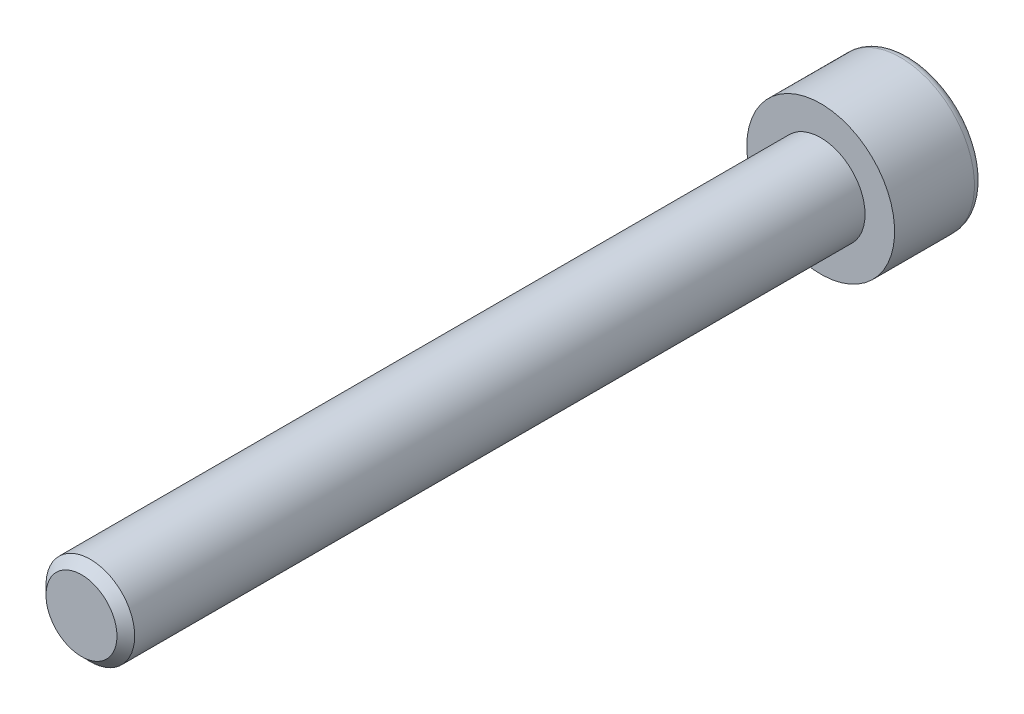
ISO-10303-21;
HEADER;
FILE_DESCRIPTION(('STEP AP214'),'2;1');
FILE_NAME('part.step','',(''),(''),'','','');
FILE_SCHEMA(('AUTOMOTIVE_DESIGN { 1 0 10303 214 1 1 1 1 }'));
ENDSEC;
DATA;
#1=APPLICATION_CONTEXT('core data for automotive mechanical design processes');
#2=APPLICATION_PROTOCOL_DEFINITION('international standard','automotive_design',2000,#1);
#3=PRODUCT_CONTEXT('',#1,'mechanical');
#4=PRODUCT('Part','Part','',(#3));
#5=PRODUCT_RELATED_PRODUCT_CATEGORY('part','',(#4));
#6=PRODUCT_DEFINITION_FORMATION('','',#4);
#7=PRODUCT_DEFINITION_CONTEXT('part definition',#1,'design');
#8=PRODUCT_DEFINITION('design','',#6,#7);
#9=PRODUCT_DEFINITION_SHAPE('','',#8);
#10=(LENGTH_UNIT() NAMED_UNIT(*) SI_UNIT(.MILLI.,.METRE.));
#11=(NAMED_UNIT(*) PLANE_ANGLE_UNIT() SI_UNIT($,.RADIAN.));
#12=(NAMED_UNIT(*) SI_UNIT($,.STERADIAN.) SOLID_ANGLE_UNIT());
#13=UNCERTAINTY_MEASURE_WITH_UNIT(LENGTH_MEASURE(1.E-05),#10,'distance_accuracy_value','');
#14=(GEOMETRIC_REPRESENTATION_CONTEXT(3) GLOBAL_UNCERTAINTY_ASSIGNED_CONTEXT((#13)) GLOBAL_UNIT_ASSIGNED_CONTEXT((#10,
#11,#12)) REPRESENTATION_CONTEXT('',''));
#15=CARTESIAN_POINT('',(0.,0.,0.));
#16=DIRECTION('',(0.,0.,1.));
#17=DIRECTION('',(1.,0.,0.));
#18=AXIS2_PLACEMENT_3D('',#15,#16,#17);
#19=CARTESIAN_POINT('',(0.,0.,-6.));
#20=DIRECTION('',(0.,0.,1.));
#21=DIRECTION('',(1.,0.,0.));
#22=AXIS2_PLACEMENT_3D('',#19,#20,#21);
#23=PLANE('',#22);
#24=CARTESIAN_POINT('',(0.,0.,-6.));
#25=DIRECTION('',(0.,0.,-1.));
#26=DIRECTION('',(-1.,0.,0.));
#27=AXIS2_PLACEMENT_3D('',#24,#25,#26);
#28=CIRCLE('',#27,4.4);
#29=CARTESIAN_POINT('',(-4.4,0.,-6.));
#30=VERTEX_POINT('',#29);
#31=EDGE_CURVE('E144',#30,#30,#28,.T.);
#32=ORIENTED_EDGE('',*,*,#31,.T.);
#33=EDGE_LOOP('',(#32));
#34=FACE_BOUND('',#33,.T.);
#35=DIRECTION('',(-0.86602540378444,0.499999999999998,0.));
#36=VECTOR('',#35,1.);
#37=CARTESIAN_POINT('',(0.,2.88675134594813,-6.));
#38=LINE('',#37,#36);
#39=CARTESIAN_POINT('',(2.5,1.44337567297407,-6.));
#40=VERTEX_POINT('',#39);
#41=CARTESIAN_POINT('',(0.,2.88675134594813,-6.));
#42=VERTEX_POINT('',#41);
#43=EDGE_CURVE('E46',#40,#42,#38,.T.);
#44=ORIENTED_EDGE('',*,*,#43,.T.);
#45=DIRECTION('',(-0.866025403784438,-0.500000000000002,0.));
#46=VECTOR('',#45,1.);
#47=CARTESIAN_POINT('',(0.,2.88675134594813,-6.));
#48=LINE('',#47,#46);
#49=CARTESIAN_POINT('',(-2.5,1.44337567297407,-6.));
#50=VERTEX_POINT('',#49);
#51=EDGE_CURVE('E117',#42,#50,#48,.T.);
#52=ORIENTED_EDGE('',*,*,#51,.T.);
#53=DIRECTION('',(0.,-1.,0.));
#54=VECTOR('',#53,1.);
#55=CARTESIAN_POINT('',(-2.5,-1.44337567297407,-6.));
#56=LINE('',#55,#54);
#57=CARTESIAN_POINT('',(-2.5,-1.44337567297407,-6.));
#58=VERTEX_POINT('',#57);
#59=EDGE_CURVE('E121',#50,#58,#56,.T.);
#60=ORIENTED_EDGE('',*,*,#59,.T.);
#61=DIRECTION('',(0.866025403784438,-0.500000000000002,0.));
#62=VECTOR('',#61,1.);
#63=CARTESIAN_POINT('',(0.,-2.88675134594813,-6.));
#64=LINE('',#63,#62);
#65=CARTESIAN_POINT('',(0.,-2.88675134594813,-6.));
#66=VERTEX_POINT('',#65);
#67=EDGE_CURVE('E124',#58,#66,#64,.T.);
#68=ORIENTED_EDGE('',*,*,#67,.T.);
#69=DIRECTION('',(0.86602540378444,0.499999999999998,0.));
#70=VECTOR('',#69,1.);
#71=CARTESIAN_POINT('',(0.,-2.88675134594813,-6.));
#72=LINE('',#71,#70);
#73=CARTESIAN_POINT('',(2.5,-1.44337567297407,-6.));
#74=VERTEX_POINT('',#73);
#75=EDGE_CURVE('E107',#66,#74,#72,.T.);
#76=ORIENTED_EDGE('',*,*,#75,.T.);
#77=DIRECTION('',(0.,1.,0.));
#78=VECTOR('',#77,1.);
#79=CARTESIAN_POINT('',(2.5,-1.44337567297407,-6.));
#80=LINE('',#79,#78);
#81=EDGE_CURVE('E127',#74,#40,#80,.T.);
#82=ORIENTED_EDGE('',*,*,#81,.T.);
#83=EDGE_LOOP('',(#44,#52,#60,#68,#76,#82));
#84=FACE_BOUND('',#83,.T.);
#85=ADVANCED_FACE('F31',(#34,#84),#23,.F.);
#86=CARTESIAN_POINT('',(0.,0.,-5.4));
#87=DIRECTION('',(0.,0.,-1.));
#88=DIRECTION('',(-1.,0.,0.));
#89=AXIS2_PLACEMENT_3D('',#86,#87,#88);
#90=TOROIDAL_SURFACE('',#89,4.4,0.600000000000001);
#91=ORIENTED_EDGE('',*,*,#31,.F.);
#92=EDGE_LOOP('',(#91));
#93=FACE_BOUND('',#92,.T.);
#94=CARTESIAN_POINT('',(0.,0.,-5.4));
#95=DIRECTION('',(0.,0.,-1.));
#96=DIRECTION('',(-1.,0.,0.));
#97=AXIS2_PLACEMENT_3D('',#94,#95,#96);
#98=CIRCLE('',#97,5.);
#99=CARTESIAN_POINT('',(-5.,0.,-5.4));
#100=VERTEX_POINT('',#99);
#101=EDGE_CURVE('E141',#100,#100,#98,.T.);
#102=ORIENTED_EDGE('',*,*,#101,.T.);
#103=EDGE_LOOP('',(#102));
#104=FACE_BOUND('',#103,.T.);
#105=ADVANCED_FACE('F161',(#93,#104),#90,.T.);
#106=CARTESIAN_POINT('',(0.,0.,0.));
#107=DIRECTION('',(0.,0.,-1.));
#108=DIRECTION('',(-1.,0.,0.));
#109=AXIS2_PLACEMENT_3D('',#106,#107,#108);
#110=CYLINDRICAL_SURFACE('',#109,5.);
#111=ORIENTED_EDGE('',*,*,#101,.F.);
#112=EDGE_LOOP('',(#111));
#113=FACE_BOUND('',#112,.T.);
#114=CARTESIAN_POINT('',(0.,0.,0.));
#115=DIRECTION('',(0.,0.,-1.));
#116=DIRECTION('',(-1.,0.,0.));
#117=AXIS2_PLACEMENT_3D('',#114,#115,#116);
#118=CIRCLE('',#117,5.);
#119=CARTESIAN_POINT('',(-5.,0.,0.));
#120=VERTEX_POINT('',#119);
#121=EDGE_CURVE('E138',#120,#120,#118,.T.);
#122=ORIENTED_EDGE('',*,*,#121,.T.);
#123=EDGE_LOOP('',(#122));
#124=FACE_BOUND('',#123,.T.);
#125=ADVANCED_FACE('F166',(#113,#124),#110,.T.);
#126=CARTESIAN_POINT('',(0.,0.,0.));
#127=DIRECTION('',(0.,0.,-1.));
#128=DIRECTION('',(-1.,0.,0.));
#129=AXIS2_PLACEMENT_3D('',#126,#127,#128);
#130=PLANE('',#129);
#131=CARTESIAN_POINT('',(0.,0.,0.));
#132=DIRECTION('',(0.,0.,1.));
#133=DIRECTION('',(1.,0.,0.));
#134=AXIS2_PLACEMENT_3D('',#131,#132,#133);
#135=CIRCLE('',#134,3.);
#136=CARTESIAN_POINT('',(3.,0.,0.));
#137=VERTEX_POINT('',#136);
#138=EDGE_CURVE('E118',#137,#137,#135,.T.);
#139=ORIENTED_EDGE('',*,*,#138,.F.);
#140=EDGE_LOOP('',(#139));
#141=FACE_BOUND('',#140,.T.);
#142=ORIENTED_EDGE('',*,*,#121,.F.);
#143=EDGE_LOOP('',(#142));
#144=FACE_BOUND('',#143,.T.);
#145=ADVANCED_FACE('F173',(#141,#144),#130,.F.);
#146=CARTESIAN_POINT('',(0.,2.88675134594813,-3.));
#147=DIRECTION('',(-0.499999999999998,-0.86602540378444,0.));
#148=DIRECTION('',(0.86602540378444,-0.499999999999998,0.));
#149=AXIS2_PLACEMENT_3D('',#146,#147,#148);
#150=PLANE('',#149);
#151=ORIENTED_EDGE('',*,*,#43,.F.);
#152=DIRECTION('',(0.,0.,-1.));
#153=VECTOR('',#152,1.);
#154=CARTESIAN_POINT('',(2.5,1.44337567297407,-3.));
#155=LINE('',#154,#153);
#156=CARTESIAN_POINT('',(2.5,1.44337567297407,-3.));
#157=VERTEX_POINT('',#156);
#158=EDGE_CURVE('E112',#157,#40,#155,.T.);
#159=ORIENTED_EDGE('',*,*,#158,.F.);
#160=DIRECTION('',(-0.86602540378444,0.499999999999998,0.));
#161=VECTOR('',#160,1.);
#162=CARTESIAN_POINT('',(0.,2.88675134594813,-3.));
#163=LINE('',#162,#161);
#164=CARTESIAN_POINT('',(0.,2.88675134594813,-3.));
#165=VERTEX_POINT('',#164);
#166=EDGE_CURVE('E130',#157,#165,#163,.T.);
#167=ORIENTED_EDGE('',*,*,#166,.T.);
#168=DIRECTION('',(0.,0.,-1.));
#169=VECTOR('',#168,1.);
#170=CARTESIAN_POINT('',(0.,2.88675134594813,-3.));
#171=LINE('',#170,#169);
#172=EDGE_CURVE('E136',#165,#42,#171,.T.);
#173=ORIENTED_EDGE('',*,*,#172,.T.);
#174=EDGE_LOOP('',(#151,#159,#167,#173));
#175=FACE_BOUND('',#174,.T.);
#176=ADVANCED_FACE('F177',(#175),#150,.T.);
#177=CARTESIAN_POINT('',(0.,2.88675134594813,-3.));
#178=DIRECTION('',(0.500000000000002,-0.866025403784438,0.));
#179=DIRECTION('',(0.866025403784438,0.500000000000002,0.));
#180=AXIS2_PLACEMENT_3D('',#177,#178,#179);
#181=PLANE('',#180);
#182=ORIENTED_EDGE('',*,*,#51,.F.);
#183=ORIENTED_EDGE('',*,*,#172,.F.);
#184=DIRECTION('',(-0.866025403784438,-0.500000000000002,0.));
#185=VECTOR('',#184,1.);
#186=CARTESIAN_POINT('',(0.,2.88675134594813,-3.));
#187=LINE('',#186,#185);
#188=CARTESIAN_POINT('',(-2.5,1.44337567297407,-3.));
#189=VERTEX_POINT('',#188);
#190=EDGE_CURVE('E85',#165,#189,#187,.T.);
#191=ORIENTED_EDGE('',*,*,#190,.T.);
#192=DIRECTION('',(0.,0.,-1.));
#193=VECTOR('',#192,1.);
#194=CARTESIAN_POINT('',(-2.5,1.44337567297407,-3.));
#195=LINE('',#194,#193);
#196=EDGE_CURVE('E134',#189,#50,#195,.T.);
#197=ORIENTED_EDGE('',*,*,#196,.T.);
#198=EDGE_LOOP('',(#182,#183,#191,#197));
#199=FACE_BOUND('',#198,.T.);
#200=ADVANCED_FACE('F181',(#199),#181,.T.);
#201=CARTESIAN_POINT('',(-2.5,-1.44337567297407,-3.));
#202=DIRECTION('',(1.,0.,0.));
#203=DIRECTION('',(0.,0.,-1.));
#204=AXIS2_PLACEMENT_3D('',#201,#202,#203);
#205=PLANE('',#204);
#206=ORIENTED_EDGE('',*,*,#59,.F.);
#207=ORIENTED_EDGE('',*,*,#196,.F.);
#208=DIRECTION('',(0.,-1.,0.));
#209=VECTOR('',#208,1.);
#210=CARTESIAN_POINT('',(-2.5,-1.44337567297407,-3.));
#211=LINE('',#210,#209);
#212=CARTESIAN_POINT('',(-2.5,-1.44337567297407,-3.));
#213=VERTEX_POINT('',#212);
#214=EDGE_CURVE('E103',#189,#213,#211,.T.);
#215=ORIENTED_EDGE('',*,*,#214,.T.);
#216=DIRECTION('',(0.,0.,-1.));
#217=VECTOR('',#216,1.);
#218=CARTESIAN_POINT('',(-2.5,-1.44337567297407,-3.));
#219=LINE('',#218,#217);
#220=EDGE_CURVE('E100',#213,#58,#219,.T.);
#221=ORIENTED_EDGE('',*,*,#220,.T.);
#222=EDGE_LOOP('',(#206,#207,#215,#221));
#223=FACE_BOUND('',#222,.T.);
#224=ADVANCED_FACE('F184',(#223),#205,.T.);
#225=CARTESIAN_POINT('',(0.,-2.88675134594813,-3.));
#226=DIRECTION('',(0.500000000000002,0.866025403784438,0.));
#227=DIRECTION('',(-0.866025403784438,0.500000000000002,0.));
#228=AXIS2_PLACEMENT_3D('',#225,#226,#227);
#229=PLANE('',#228);
#230=ORIENTED_EDGE('',*,*,#67,.F.);
#231=ORIENTED_EDGE('',*,*,#220,.F.);
#232=DIRECTION('',(0.866025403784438,-0.500000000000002,0.));
#233=VECTOR('',#232,1.);
#234=CARTESIAN_POINT('',(0.,-2.88675134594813,-3.));
#235=LINE('',#234,#233);
#236=CARTESIAN_POINT('',(0.,-2.88675134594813,-3.));
#237=VERTEX_POINT('',#236);
#238=EDGE_CURVE('E95',#213,#237,#235,.T.);
#239=ORIENTED_EDGE('',*,*,#238,.T.);
#240=DIRECTION('',(0.,0.,-1.));
#241=VECTOR('',#240,1.);
#242=CARTESIAN_POINT('',(0.,-2.88675134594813,-3.));
#243=LINE('',#242,#241);
#244=EDGE_CURVE('E99',#237,#66,#243,.T.);
#245=ORIENTED_EDGE('',*,*,#244,.T.);
#246=EDGE_LOOP('',(#230,#231,#239,#245));
#247=FACE_BOUND('',#246,.T.);
#248=ADVANCED_FACE('F98',(#247),#229,.T.);
#249=CARTESIAN_POINT('',(0.,-2.88675134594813,-3.));
#250=DIRECTION('',(-0.499999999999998,0.86602540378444,0.));
#251=DIRECTION('',(-0.86602540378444,-0.499999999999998,0.));
#252=AXIS2_PLACEMENT_3D('',#249,#250,#251);
#253=PLANE('',#252);
#254=ORIENTED_EDGE('',*,*,#75,.F.);
#255=ORIENTED_EDGE('',*,*,#244,.F.);
#256=DIRECTION('',(0.86602540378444,0.499999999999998,0.));
#257=VECTOR('',#256,1.);
#258=CARTESIAN_POINT('',(0.,-2.88675134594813,-3.));
#259=LINE('',#258,#257);
#260=CARTESIAN_POINT('',(2.5,-1.44337567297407,-3.));
#261=VERTEX_POINT('',#260);
#262=EDGE_CURVE('E102',#237,#261,#259,.T.);
#263=ORIENTED_EDGE('',*,*,#262,.T.);
#264=DIRECTION('',(0.,0.,-1.));
#265=VECTOR('',#264,1.);
#266=CARTESIAN_POINT('',(2.5,-1.44337567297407,-3.));
#267=LINE('',#266,#265);
#268=EDGE_CURVE('E76',#261,#74,#267,.T.);
#269=ORIENTED_EDGE('',*,*,#268,.T.);
#270=EDGE_LOOP('',(#254,#255,#263,#269));
#271=FACE_BOUND('',#270,.T.);
#272=ADVANCED_FACE('F105',(#271),#253,.T.);
#273=CARTESIAN_POINT('',(2.5,-1.44337567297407,-3.));
#274=DIRECTION('',(-1.,0.,0.));
#275=DIRECTION('',(0.,0.,1.));
#276=AXIS2_PLACEMENT_3D('',#273,#274,#275);
#277=PLANE('',#276);
#278=ORIENTED_EDGE('',*,*,#81,.F.);
#279=ORIENTED_EDGE('',*,*,#268,.F.);
#280=DIRECTION('',(0.,1.,0.));
#281=VECTOR('',#280,1.);
#282=CARTESIAN_POINT('',(2.5,-1.44337567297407,-3.));
#283=LINE('',#282,#281);
#284=EDGE_CURVE('E54',#261,#157,#283,.T.);
#285=ORIENTED_EDGE('',*,*,#284,.T.);
#286=ORIENTED_EDGE('',*,*,#158,.T.);
#287=EDGE_LOOP('',(#278,#279,#285,#286));
#288=FACE_BOUND('',#287,.T.);
#289=ADVANCED_FACE('F193',(#288),#277,.T.);
#290=CARTESIAN_POINT('',(2.5,1.44337567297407,-3.));
#291=DIRECTION('',(0.,0.,1.));
#292=DIRECTION('',(1.,0.,0.));
#293=AXIS2_PLACEMENT_3D('',#290,#291,#292);
#294=PLANE('',#293);
#295=ORIENTED_EDGE('',*,*,#166,.F.);
#296=ORIENTED_EDGE('',*,*,#284,.F.);
#297=ORIENTED_EDGE('',*,*,#262,.F.);
#298=ORIENTED_EDGE('',*,*,#238,.F.);
#299=ORIENTED_EDGE('',*,*,#214,.F.);
#300=ORIENTED_EDGE('',*,*,#190,.F.);
#301=EDGE_LOOP('',(#295,#296,#297,#298,#299,#300));
#302=FACE_BOUND('',#301,.T.);
#303=ADVANCED_FACE('F110',(#302),#294,.F.);
#304=CARTESIAN_POINT('',(0.,0.,50.));
#305=DIRECTION('',(0.,0.,1.));
#306=DIRECTION('',(1.,0.,0.));
#307=AXIS2_PLACEMENT_3D('',#304,#305,#306);
#308=PLANE('',#307);
#309=CARTESIAN_POINT('',(0.,0.,50.));
#310=DIRECTION('',(0.,0.,1.));
#311=DIRECTION('',(1.,0.,0.));
#312=AXIS2_PLACEMENT_3D('',#309,#310,#311);
#313=CIRCLE('',#312,2.39999999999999);
#314=CARTESIAN_POINT('',(2.4,0.,50.));
#315=VERTEX_POINT('',#314);
#316=EDGE_CURVE('E39',#315,#315,#313,.T.);
#317=ORIENTED_EDGE('',*,*,#316,.T.);
#318=EDGE_LOOP('',(#317));
#319=FACE_BOUND('',#318,.T.);
#320=ADVANCED_FACE('F149',(#319),#308,.T.);
#321=CARTESIAN_POINT('',(0.,0.,0.));
#322=DIRECTION('',(0.,0.,1.));
#323=DIRECTION('',(1.,0.,0.));
#324=AXIS2_PLACEMENT_3D('',#321,#322,#323);
#325=CYLINDRICAL_SURFACE('',#324,3.);
#326=CARTESIAN_POINT('',(0.,0.,49.4));
#327=DIRECTION('',(0.,0.,1.));
#328=DIRECTION('',(1.,0.,0.));
#329=AXIS2_PLACEMENT_3D('',#326,#327,#328);
#330=CIRCLE('',#329,3.);
#331=CARTESIAN_POINT('',(3.00000000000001,0.,49.4));
#332=VERTEX_POINT('',#331);
#333=EDGE_CURVE('E11',#332,#332,#330,.F.);
#334=ORIENTED_EDGE('',*,*,#333,.T.);
#335=EDGE_LOOP('',(#334));
#336=FACE_BOUND('',#335,.T.);
#337=ORIENTED_EDGE('',*,*,#138,.T.);
#338=EDGE_LOOP('',(#337));
#339=FACE_BOUND('',#338,.T.);
#340=ADVANCED_FACE('F152',(#336,#339),#325,.T.);
#341=CARTESIAN_POINT('',(0.,0.,50.));
#342=DIRECTION('',(0.,0.,-1.));
#343=DIRECTION('',(-1.,0.,0.));
#344=AXIS2_PLACEMENT_3D('',#341,#342,#343);
#345=CONICAL_SURFACE('',#344,2.39999999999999,0.78539816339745);
#346=ORIENTED_EDGE('',*,*,#333,.F.);
#347=EDGE_LOOP('',(#346));
#348=FACE_BOUND('',#347,.T.);
#349=ORIENTED_EDGE('',*,*,#316,.F.);
#350=EDGE_LOOP('',(#349));
#351=FACE_BOUND('',#350,.T.);
#352=ADVANCED_FACE('F33',(#348,#351),#345,.T.);
#353=CLOSED_SHELL('',(#85,#105,#125,#145,#176,#200,#224,#248,#272,#289,#303,#320,#340,#352));
#354=MANIFOLD_SOLID_BREP('B2',#353);
#355=ADVANCED_BREP_SHAPE_REPRESENTATION('',(#18,#354),#14);
#356=SHAPE_DEFINITION_REPRESENTATION(#9,#355);
ENDSEC;
END-ISO-10303-21;
